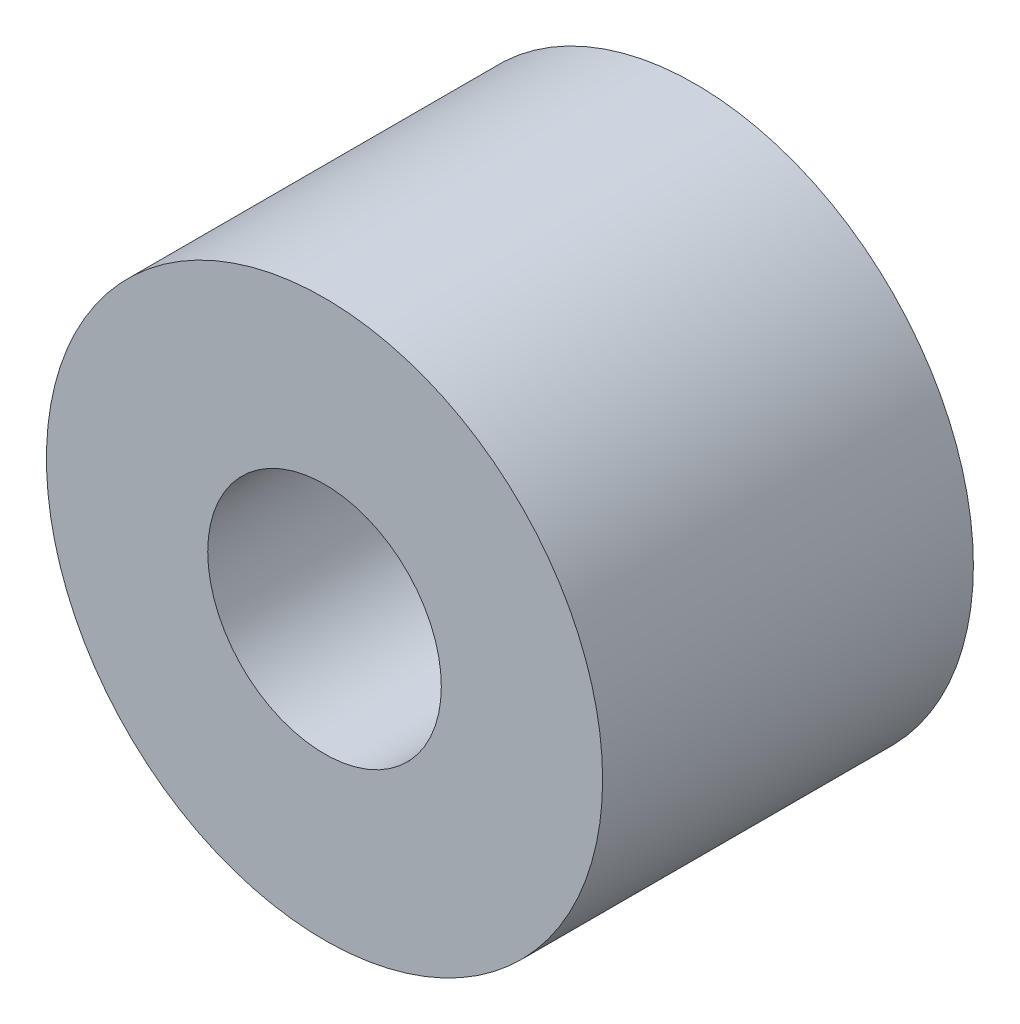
ISO-10303-21;
HEADER;
FILE_DESCRIPTION(('STEP AP214'),'2;1');
FILE_NAME('part.step','',(''),(''),'','','');
FILE_SCHEMA(('AUTOMOTIVE_DESIGN { 1 0 10303 214 1 1 1 1 }'));
ENDSEC;
DATA;
#1=APPLICATION_CONTEXT('core data for automotive mechanical design processes');
#2=APPLICATION_PROTOCOL_DEFINITION('international standard','automotive_design',2000,#1);
#3=PRODUCT_CONTEXT('',#1,'mechanical');
#4=PRODUCT('Part','Part','',(#3));
#5=PRODUCT_RELATED_PRODUCT_CATEGORY('part','',(#4));
#6=PRODUCT_DEFINITION_FORMATION('','',#4);
#7=PRODUCT_DEFINITION_CONTEXT('part definition',#1,'design');
#8=PRODUCT_DEFINITION('design','',#6,#7);
#9=PRODUCT_DEFINITION_SHAPE('','',#8);
#10=(LENGTH_UNIT() NAMED_UNIT(*) SI_UNIT(.MILLI.,.METRE.));
#11=(NAMED_UNIT(*) PLANE_ANGLE_UNIT() SI_UNIT($,.RADIAN.));
#12=(NAMED_UNIT(*) SI_UNIT($,.STERADIAN.) SOLID_ANGLE_UNIT());
#13=UNCERTAINTY_MEASURE_WITH_UNIT(LENGTH_MEASURE(1.E-05),#10,'distance_accuracy_value','');
#14=(GEOMETRIC_REPRESENTATION_CONTEXT(3) GLOBAL_UNCERTAINTY_ASSIGNED_CONTEXT((#13)) GLOBAL_UNIT_ASSIGNED_CONTEXT((#10,
#11,#12)) REPRESENTATION_CONTEXT('',''));
#15=CARTESIAN_POINT('',(0.,0.,0.));
#16=DIRECTION('',(0.,0.,1.));
#17=DIRECTION('',(1.,0.,0.));
#18=AXIS2_PLACEMENT_3D('',#15,#16,#17);
#19=CARTESIAN_POINT('',(0.,0.,12.7));
#20=DIRECTION('',(0.,0.,1.));
#21=DIRECTION('',(1.,0.,0.));
#22=AXIS2_PLACEMENT_3D('',#19,#20,#21);
#23=PLANE('',#22);
#24=CARTESIAN_POINT('',(0.,0.,12.7));
#25=DIRECTION('',(0.,0.,1.));
#26=DIRECTION('',(1.,0.,0.));
#27=AXIS2_PLACEMENT_3D('',#24,#25,#26);
#28=CIRCLE('',#27,9.525);
#29=CARTESIAN_POINT('',(9.525,0.,12.7));
#30=VERTEX_POINT('',#29);
#31=EDGE_CURVE('E10',#30,#30,#28,.T.);
#32=ORIENTED_EDGE('',*,*,#31,.T.);
#33=EDGE_LOOP('',(#32));
#34=FACE_BOUND('',#33,.T.);
#35=CARTESIAN_POINT('',(0.,0.,12.7));
#36=DIRECTION('',(0.,0.,1.));
#37=DIRECTION('',(1.,0.,0.));
#38=AXIS2_PLACEMENT_3D('',#35,#36,#37);
#39=CIRCLE('',#38,4.0005);
#40=CARTESIAN_POINT('',(4.0005,0.,12.7));
#41=VERTEX_POINT('',#40);
#42=EDGE_CURVE('E42',#41,#41,#39,.T.);
#43=ORIENTED_EDGE('',*,*,#42,.F.);
#44=EDGE_LOOP('',(#43));
#45=FACE_BOUND('',#44,.T.);
#46=ADVANCED_FACE('F31',(#34,#45),#23,.T.);
#47=CARTESIAN_POINT('',(0.,0.,0.));
#48=DIRECTION('',(0.,0.,1.));
#49=DIRECTION('',(1.,0.,0.));
#50=AXIS2_PLACEMENT_3D('',#47,#48,#49);
#51=PLANE('',#50);
#52=CARTESIAN_POINT('',(0.,0.,0.));
#53=DIRECTION('',(0.,0.,1.));
#54=DIRECTION('',(1.,0.,0.));
#55=AXIS2_PLACEMENT_3D('',#52,#53,#54);
#56=CIRCLE('',#55,9.525);
#57=CARTESIAN_POINT('',(9.525,0.,0.));
#58=VERTEX_POINT('',#57);
#59=EDGE_CURVE('E35',#58,#58,#56,.T.);
#60=ORIENTED_EDGE('',*,*,#59,.F.);
#61=EDGE_LOOP('',(#60));
#62=FACE_BOUND('',#61,.T.);
#63=CARTESIAN_POINT('',(0.,0.,0.));
#64=DIRECTION('',(0.,0.,1.));
#65=DIRECTION('',(1.,0.,0.));
#66=AXIS2_PLACEMENT_3D('',#63,#64,#65);
#67=CIRCLE('',#66,4.0005);
#68=CARTESIAN_POINT('',(4.0005,0.,0.));
#69=VERTEX_POINT('',#68);
#70=EDGE_CURVE('E44',#69,#69,#67,.T.);
#71=ORIENTED_EDGE('',*,*,#70,.T.);
#72=EDGE_LOOP('',(#71));
#73=FACE_BOUND('',#72,.T.);
#74=ADVANCED_FACE('F54',(#62,#73),#51,.F.);
#75=CARTESIAN_POINT('',(0.,0.,12.7));
#76=DIRECTION('',(0.,0.,-1.));
#77=DIRECTION('',(-1.,0.,0.));
#78=AXIS2_PLACEMENT_3D('',#75,#76,#77);
#79=CYLINDRICAL_SURFACE('',#78,9.525);
#80=ORIENTED_EDGE('',*,*,#31,.F.);
#81=EDGE_LOOP('',(#80));
#82=FACE_BOUND('',#81,.T.);
#83=ORIENTED_EDGE('',*,*,#59,.T.);
#84=EDGE_LOOP('',(#83));
#85=FACE_BOUND('',#84,.T.);
#86=ADVANCED_FACE('F33',(#82,#85),#79,.T.);
#87=CARTESIAN_POINT('',(0.,0.,12.7));
#88=DIRECTION('',(0.,0.,-1.));
#89=DIRECTION('',(-1.,0.,0.));
#90=AXIS2_PLACEMENT_3D('',#87,#88,#89);
#91=CYLINDRICAL_SURFACE('',#90,4.0005);
#92=ORIENTED_EDGE('',*,*,#42,.T.);
#93=EDGE_LOOP('',(#92));
#94=FACE_BOUND('',#93,.T.);
#95=ORIENTED_EDGE('',*,*,#70,.F.);
#96=EDGE_LOOP('',(#95));
#97=FACE_BOUND('',#96,.T.);
#98=ADVANCED_FACE('F50',(#94,#97),#91,.F.);
#99=CLOSED_SHELL('',(#46,#74,#86,#98));
#100=MANIFOLD_SOLID_BREP('B2',#99);
#101=ADVANCED_BREP_SHAPE_REPRESENTATION('',(#18,#100),#14);
#102=SHAPE_DEFINITION_REPRESENTATION(#9,#101);
ENDSEC;
END-ISO-10303-21;
